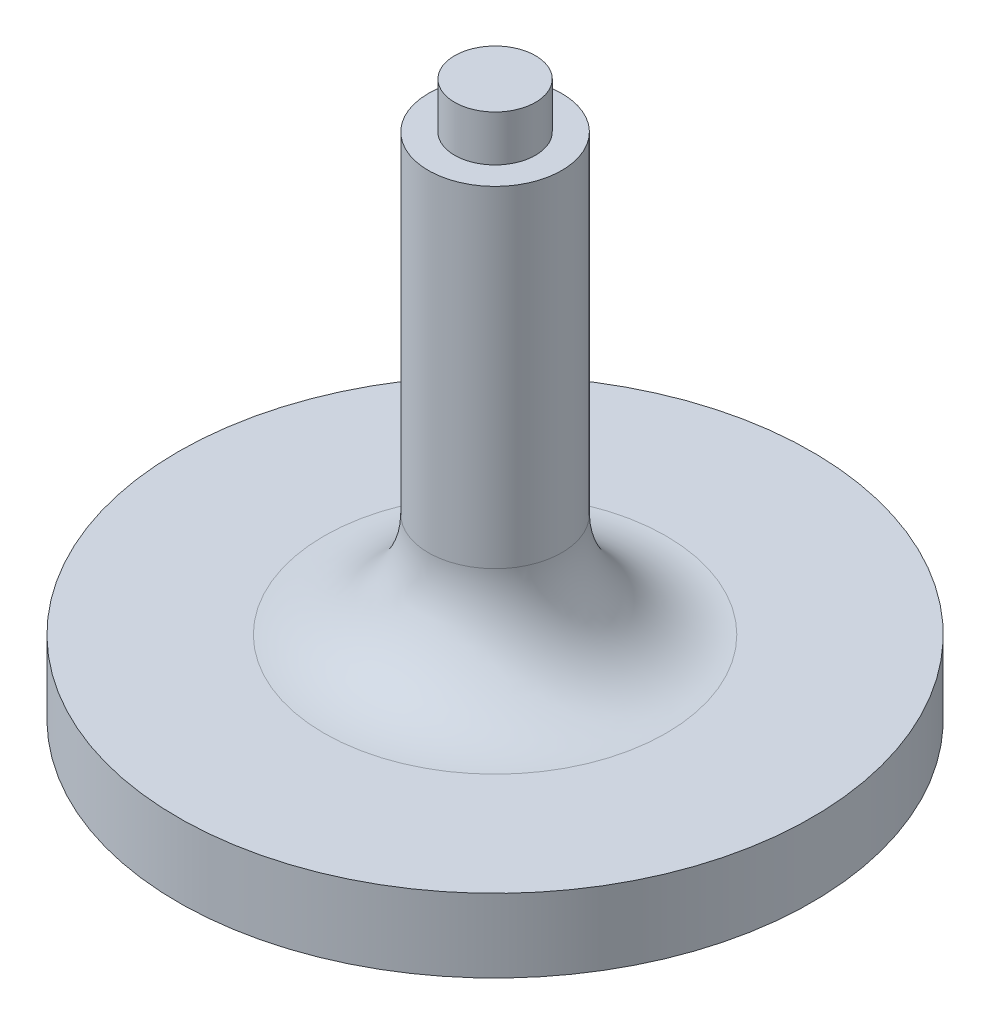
from build123d import *


with BuildPart() as part:
    # Sketch1 → Revolve1 (revolve)
    with BuildSketch(Plane.XY, mode=Mode.PRIVATE) as revolve1_sk:
        with BuildLine():
            Line((0, -16.891), (9.652, -16.891))
            Line((9.652, -16.891), (9.652, -14.6558))
            Line((9.652, -14.6558), (5.207, -14.6558))
            ThreePointArc((5.207, -14.6558), (2.96193597, -13.72586403), (2.032, -11.4808))
            Line((2.032, -11.4808), (2.032, -1.397))
            Line((2.032, -1.397), (1.2319, -1.397))
            Line((1.2319, -1.397), (1.2319, 0))
            Line((1.2319, 0), (0, 0))
            Line((0, 0), (0, -16.891))
        make_face()
    revolve(revolve1_sk.sketch.rotate(Axis((0, 0, 0), (0, -1, 0)), 180), axis=Axis((0, 0, 0), (0, -1, 0)))


solid = part.part
